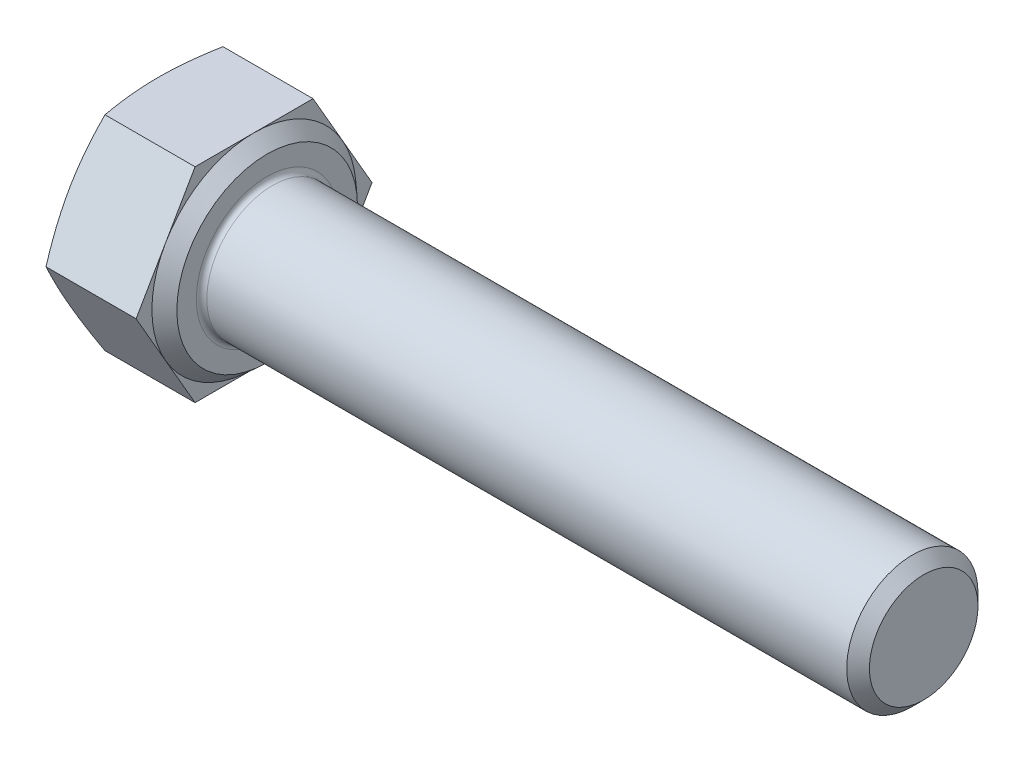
from build123d import *

# Parameters (mm, degrees)
BASEHEAD_DEPTH = 3.65
SKETCH3_R      = 2.5
BASEBODY_DEPTH = 25
HEADFILLET_R   = 0.2
CHAMFER1_SIZE  = 0.433


with BuildPart() as part:
    # Sketch-BaseHead → BaseHead (new body)
    with BuildSketch(Plane(origin=(0, 0, 0), x_dir=(0, 0, -1), z_dir=(1, 0, 0))):
        Polygon((4.491785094, 0), (2.245892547, 3.89), (-2.245892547, 3.89), (-4.491785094, 0), (-2.245892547, -3.89), (2.245892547, -3.89), align=None)
    extrude(amount=BASEHEAD_DEPTH)

    # Sketch4 → HeadChamfer (revolve, cut)
    with BuildSketch(Plane(origin=(-0.264637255, 0, 5.916896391), x_dir=(0, 0, -1), z_dir=(0, 1, 0))):
        Polygon((10.408681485, -0.264637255), (9.806896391, -0.264637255), (10.408681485, -0.483669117), align=None)
    revolve(axis=Axis((-4.001564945, 0, 0), (1, 0, 0)), mode=Mode.SUBTRACT)

    # Sketch1 → Revolve1 (revolve)
    with BuildSketch(Plane.XY, mode=Mode.PRIVATE) as revolve1_sk:
        Polygon((3.65, 0), (4.15, 0), (4.15, -3.44), (3.65, -3.89), align=None)
    revolve(revolve1_sk.sketch.rotate(Axis((-4.001564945, 0, 0), (1, 0, 0)), 270), axis=Axis((-4.001564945, 0, 0), (1, 0, 0)))

    # Sketch3 → BaseBody (add)
    with BuildSketch(Plane(origin=(4.15, 0, 0), x_dir=(0, 0, -1), z_dir=(1, 0, 0))):
        Circle(SKETCH3_R)
    extrude(amount=BASEBODY_DEPTH)

    # HeadFillet
    headfillet_edges = [part.edges().sort_by_distance(p)[0] for p in [
        (4.15, 0, 2.5),
    ]]
    fillet(headfillet_edges, radius=HEADFILLET_R)

    # Chamfer1
    chamfer1_edges = [part.edges().sort_by_distance(p)[0] for p in [
        (29.15, 0, 2.5),
    ]]
    chamfer(chamfer1_edges, length=CHAMFER1_SIZE)


solid = part.part
